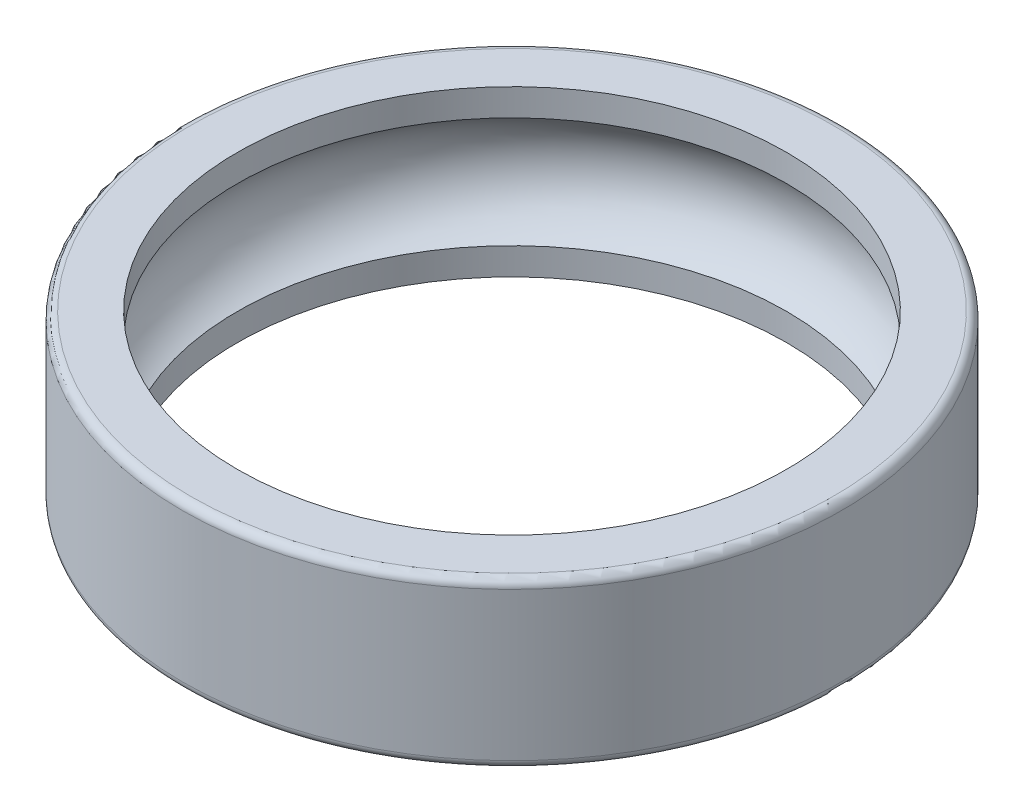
ISO-10303-21;
HEADER;
FILE_DESCRIPTION(('STEP AP214'),'2;1');
FILE_NAME('part.step','',(''),(''),'','','');
FILE_SCHEMA(('AUTOMOTIVE_DESIGN { 1 0 10303 214 1 1 1 1 }'));
ENDSEC;
DATA;
#1=APPLICATION_CONTEXT('core data for automotive mechanical design processes');
#2=APPLICATION_PROTOCOL_DEFINITION('international standard','automotive_design',2000,#1);
#3=PRODUCT_CONTEXT('',#1,'mechanical');
#4=PRODUCT('Part','Part','',(#3));
#5=PRODUCT_RELATED_PRODUCT_CATEGORY('part','',(#4));
#6=PRODUCT_DEFINITION_FORMATION('','',#4);
#7=PRODUCT_DEFINITION_CONTEXT('part definition',#1,'design');
#8=PRODUCT_DEFINITION('design','',#6,#7);
#9=PRODUCT_DEFINITION_SHAPE('','',#8);
#10=(LENGTH_UNIT() NAMED_UNIT(*) SI_UNIT(.MILLI.,.METRE.));
#11=(NAMED_UNIT(*) PLANE_ANGLE_UNIT() SI_UNIT($,.RADIAN.));
#12=(NAMED_UNIT(*) SI_UNIT($,.STERADIAN.) SOLID_ANGLE_UNIT());
#13=UNCERTAINTY_MEASURE_WITH_UNIT(LENGTH_MEASURE(1.E-05),#10,'distance_accuracy_value','');
#14=(GEOMETRIC_REPRESENTATION_CONTEXT(3) GLOBAL_UNCERTAINTY_ASSIGNED_CONTEXT((#13)) GLOBAL_UNIT_ASSIGNED_CONTEXT((#10,
#11,#12)) REPRESENTATION_CONTEXT('',''));
#15=CARTESIAN_POINT('',(0.,0.,0.));
#16=DIRECTION('',(0.,0.,1.));
#17=DIRECTION('',(1.,0.,0.));
#18=AXIS2_PLACEMENT_3D('',#15,#16,#17);
#19=CARTESIAN_POINT('',(12.,-3.,0.));
#20=DIRECTION('',(0.,-1.,0.));
#21=DIRECTION('',(0.,0.,-1.));
#22=AXIS2_PLACEMENT_3D('',#19,#20,#21);
#23=PLANE('',#22);
#24=CARTESIAN_POINT('',(0.,-3.,0.));
#25=DIRECTION('',(0.,-1.,0.));
#26=DIRECTION('',(0.,0.,-1.));
#27=AXIS2_PLACEMENT_3D('',#24,#25,#26);
#28=CIRCLE('',#27,11.7);
#29=CARTESIAN_POINT('',(0.,-3.,-11.7));
#30=VERTEX_POINT('',#29);
#31=EDGE_CURVE('E10',#30,#30,#28,.T.);
#32=ORIENTED_EDGE('',*,*,#31,.T.);
#33=EDGE_LOOP('',(#32));
#34=FACE_BOUND('',#33,.T.);
#35=CARTESIAN_POINT('',(0.,-3.,0.));
#36=DIRECTION('',(0.,1.,0.));
#37=DIRECTION('',(0.,0.,1.));
#38=AXIS2_PLACEMENT_3D('',#35,#36,#37);
#39=CIRCLE('',#38,10.);
#40=CARTESIAN_POINT('',(0.,-3.,10.));
#41=VERTEX_POINT('',#40);
#42=EDGE_CURVE('E59',#41,#41,#39,.T.);
#43=ORIENTED_EDGE('',*,*,#42,.T.);
#44=EDGE_LOOP('',(#43));
#45=FACE_BOUND('',#44,.T.);
#46=ADVANCED_FACE('F30',(#34,#45),#23,.T.);
#47=CARTESIAN_POINT('',(0.,-3.,0.));
#48=DIRECTION('',(0.,1.,0.));
#49=DIRECTION('',(0.,0.,1.));
#50=AXIS2_PLACEMENT_3D('',#47,#48,#49);
#51=CYLINDRICAL_SURFACE('',#50,12.);
#52=CARTESIAN_POINT('',(0.,2.7,0.));
#53=DIRECTION('',(0.,1.,0.));
#54=DIRECTION('',(0.,0.,1.));
#55=AXIS2_PLACEMENT_3D('',#52,#53,#54);
#56=CIRCLE('',#55,12.);
#57=CARTESIAN_POINT('',(0.,2.7,12.));
#58=VERTEX_POINT('',#57);
#59=EDGE_CURVE('E37',#58,#58,#56,.F.);
#60=ORIENTED_EDGE('',*,*,#59,.T.);
#61=EDGE_LOOP('',(#60));
#62=FACE_BOUND('',#61,.T.);
#63=CARTESIAN_POINT('',(0.,-2.7,0.));
#64=DIRECTION('',(0.,-1.,0.));
#65=DIRECTION('',(0.,0.,-1.));
#66=AXIS2_PLACEMENT_3D('',#63,#64,#65);
#67=CIRCLE('',#66,12.);
#68=CARTESIAN_POINT('',(0.,-2.7,-12.));
#69=VERTEX_POINT('',#68);
#70=EDGE_CURVE('E41',#69,#69,#67,.F.);
#71=ORIENTED_EDGE('',*,*,#70,.T.);
#72=EDGE_LOOP('',(#71));
#73=FACE_BOUND('',#72,.T.);
#74=ADVANCED_FACE('F79',(#62,#73),#51,.T.);
#75=CARTESIAN_POINT('',(10.,3.,0.));
#76=DIRECTION('',(0.,1.,0.));
#77=DIRECTION('',(0.,0.,1.));
#78=AXIS2_PLACEMENT_3D('',#75,#76,#77);
#79=PLANE('',#78);
#80=CARTESIAN_POINT('',(0.,3.,0.));
#81=DIRECTION('',(0.,1.,0.));
#82=DIRECTION('',(0.,0.,1.));
#83=AXIS2_PLACEMENT_3D('',#80,#81,#82);
#84=CIRCLE('',#83,11.7);
#85=CARTESIAN_POINT('',(0.,3.,11.7));
#86=VERTEX_POINT('',#85);
#87=EDGE_CURVE('E45',#86,#86,#84,.T.);
#88=ORIENTED_EDGE('',*,*,#87,.T.);
#89=EDGE_LOOP('',(#88));
#90=FACE_BOUND('',#89,.T.);
#91=CARTESIAN_POINT('',(0.,3.,0.));
#92=DIRECTION('',(0.,1.,0.));
#93=DIRECTION('',(0.,0.,1.));
#94=AXIS2_PLACEMENT_3D('',#91,#92,#93);
#95=CIRCLE('',#94,10.);
#96=CARTESIAN_POINT('',(0.,3.,10.));
#97=VERTEX_POINT('',#96);
#98=EDGE_CURVE('E50',#97,#97,#95,.T.);
#99=ORIENTED_EDGE('',*,*,#98,.F.);
#100=EDGE_LOOP('',(#99));
#101=FACE_BOUND('',#100,.T.);
#102=ADVANCED_FACE('F84',(#90,#101),#79,.T.);
#103=CARTESIAN_POINT('',(0.,-3.,0.));
#104=DIRECTION('',(0.,1.,0.));
#105=DIRECTION('',(0.,0.,1.));
#106=AXIS2_PLACEMENT_3D('',#103,#104,#105);
#107=CYLINDRICAL_SURFACE('',#106,10.);
#108=ORIENTED_EDGE('',*,*,#98,.T.);
#109=EDGE_LOOP('',(#108));
#110=FACE_BOUND('',#109,.T.);
#111=CARTESIAN_POINT('',(0.,2.01556443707,0.));
#112=DIRECTION('',(0.,1.,0.));
#113=DIRECTION('',(0.,0.,1.));
#114=AXIS2_PLACEMENT_3D('',#111,#112,#113);
#115=CIRCLE('',#114,10.);
#116=CARTESIAN_POINT('',(0.,2.01556443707,10.));
#117=VERTEX_POINT('',#116);
#118=EDGE_CURVE('E53',#117,#117,#115,.T.);
#119=ORIENTED_EDGE('',*,*,#118,.F.);
#120=EDGE_LOOP('',(#119));
#121=FACE_BOUND('',#120,.T.);
#122=ADVANCED_FACE('F75',(#110,#121),#107,.F.);
#123=CARTESIAN_POINT('',(0.,0.,0.));
#124=DIRECTION('',(0.,1.,0.));
#125=DIRECTION('',(0.,0.,1.));
#126=AXIS2_PLACEMENT_3D('',#123,#124,#125);
#127=TOROIDAL_SURFACE('',#126,9.,2.24999999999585);
#128=ORIENTED_EDGE('',*,*,#118,.T.);
#129=EDGE_LOOP('',(#128));
#130=FACE_BOUND('',#129,.T.);
#131=CARTESIAN_POINT('',(0.,-2.01556443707,0.));
#132=DIRECTION('',(0.,1.,0.));
#133=DIRECTION('',(0.,0.,1.));
#134=AXIS2_PLACEMENT_3D('',#131,#132,#133);
#135=CIRCLE('',#134,10.);
#136=CARTESIAN_POINT('',(0.,-2.01556443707,10.));
#137=VERTEX_POINT('',#136);
#138=EDGE_CURVE('E56',#137,#137,#135,.T.);
#139=ORIENTED_EDGE('',*,*,#138,.F.);
#140=EDGE_LOOP('',(#139));
#141=FACE_BOUND('',#140,.T.);
#142=ADVANCED_FACE('F67',(#130,#141),#127,.F.);
#143=CARTESIAN_POINT('',(0.,-3.,0.));
#144=DIRECTION('',(0.,1.,0.));
#145=DIRECTION('',(0.,0.,1.));
#146=AXIS2_PLACEMENT_3D('',#143,#144,#145);
#147=CYLINDRICAL_SURFACE('',#146,10.);
#148=ORIENTED_EDGE('',*,*,#138,.T.);
#149=EDGE_LOOP('',(#148));
#150=FACE_BOUND('',#149,.T.);
#151=ORIENTED_EDGE('',*,*,#42,.F.);
#152=EDGE_LOOP('',(#151));
#153=FACE_BOUND('',#152,.T.);
#154=ADVANCED_FACE('F64',(#150,#153),#147,.F.);
#155=CARTESIAN_POINT('',(0.,2.7,0.));
#156=DIRECTION('',(0.,1.,0.));
#157=DIRECTION('',(0.,0.,1.));
#158=AXIS2_PLACEMENT_3D('',#155,#156,#157);
#159=TOROIDAL_SURFACE('',#158,11.7,0.3);
#160=ORIENTED_EDGE('',*,*,#59,.F.);
#161=EDGE_LOOP('',(#160));
#162=FACE_BOUND('',#161,.T.);
#163=ORIENTED_EDGE('',*,*,#87,.F.);
#164=EDGE_LOOP('',(#163));
#165=FACE_BOUND('',#164,.T.);
#166=ADVANCED_FACE('F66',(#162,#165),#159,.T.);
#167=CARTESIAN_POINT('',(0.,-2.7,0.));
#168=DIRECTION('',(0.,-1.,0.));
#169=DIRECTION('',(0.,0.,-1.));
#170=AXIS2_PLACEMENT_3D('',#167,#168,#169);
#171=TOROIDAL_SURFACE('',#170,11.7,0.3);
#172=ORIENTED_EDGE('',*,*,#31,.F.);
#173=EDGE_LOOP('',(#172));
#174=FACE_BOUND('',#173,.T.);
#175=ORIENTED_EDGE('',*,*,#70,.F.);
#176=EDGE_LOOP('',(#175));
#177=FACE_BOUND('',#176,.T.);
#178=ADVANCED_FACE('F32',(#174,#177),#171,.T.);
#179=CLOSED_SHELL('',(#46,#74,#102,#122,#142,#154,#166,#178));
#180=MANIFOLD_SOLID_BREP('B2',#179);
#181=ADVANCED_BREP_SHAPE_REPRESENTATION('',(#18,#180),#14);
#182=SHAPE_DEFINITION_REPRESENTATION(#9,#181);
ENDSEC;
END-ISO-10303-21;
